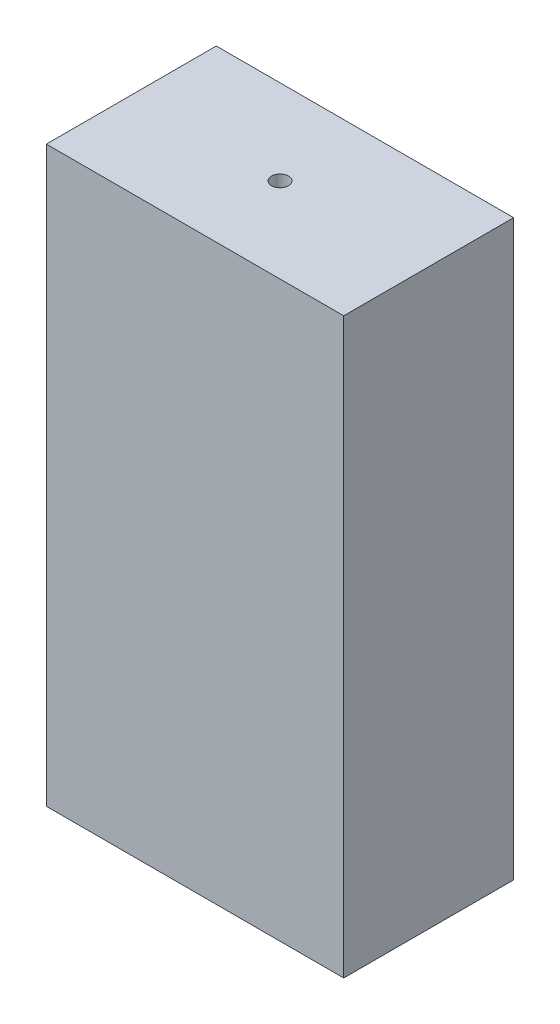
from build123d import *

# Parameters (mm, degrees)
SKETCH1_W                      = 88.9
SKETCH1_H                      = 50.8
BOSS_EXTRUDE1_DEPTH            = 171.45
F_8_0_199_DIAMETER_HOLE1_D     = 5.0546
F_8_0_199_DIAMETER_HOLE1_DEPTH = 25.4
F_8_0_199_DIAMETER_HOLE1_TIP   = 1.518555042


with BuildPart() as part:
    # Sketch1 → Boss-Extrude1 (new body)
    with BuildSketch(Plane(origin=(0, 0, 0), x_dir=(1, 0, 0), z_dir=(0, 1, 0))):
        Rectangle(SKETCH1_W, SKETCH1_H)
    extrude(amount=BOSS_EXTRUDE1_DEPTH)

    # 8 _0.199_ Diameter Hole1
    with Locations(Plane(origin=(0, 171.45, 0), x_dir=(1, 0, 0), z_dir=(0, 1, 0))):
        with Locations((0, 0)):
            Hole(F_8_0_199_DIAMETER_HOLE1_D / 2, depth=F_8_0_199_DIAMETER_HOLE1_DEPTH)
            with Locations((0, 0, -(F_8_0_199_DIAMETER_HOLE1_DEPTH + F_8_0_199_DIAMETER_HOLE1_TIP / 2))):  # 118° drill point
                Cone(0, F_8_0_199_DIAMETER_HOLE1_D / 2, F_8_0_199_DIAMETER_HOLE1_TIP, mode=Mode.SUBTRACT)


solid = part.part
